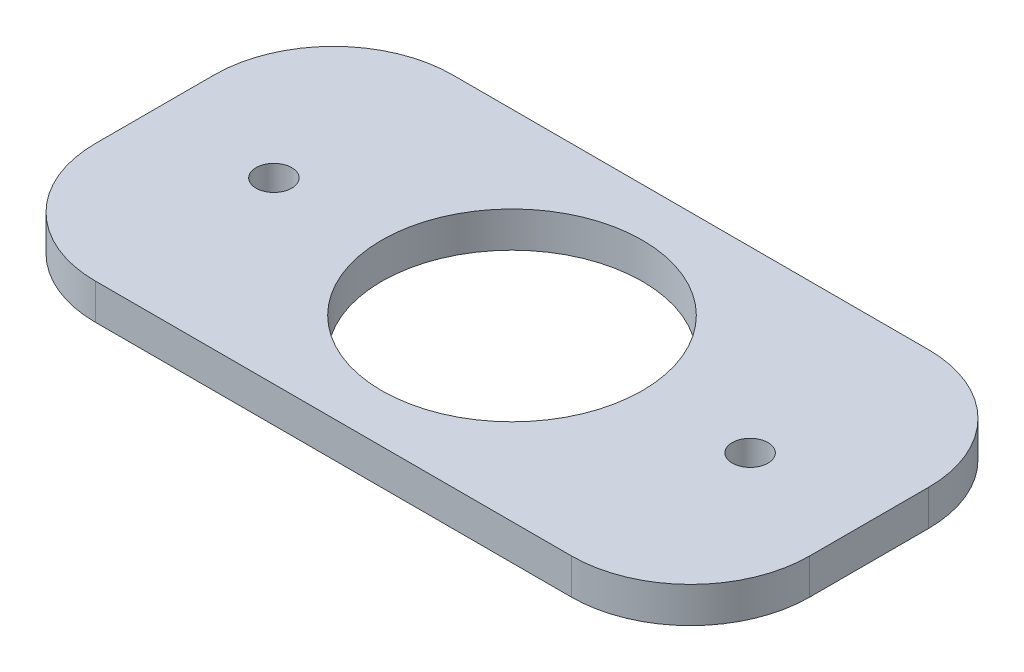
ISO-10303-21;
HEADER;
FILE_DESCRIPTION(('STEP AP214'),'2;1');
FILE_NAME('part.step','',(''),(''),'','','');
FILE_SCHEMA(('AUTOMOTIVE_DESIGN { 1 0 10303 214 1 1 1 1 }'));
ENDSEC;
DATA;
#1=APPLICATION_CONTEXT('core data for automotive mechanical design processes');
#2=APPLICATION_PROTOCOL_DEFINITION('international standard','automotive_design',2000,#1);
#3=PRODUCT_CONTEXT('',#1,'mechanical');
#4=PRODUCT('Part','Part','',(#3));
#5=PRODUCT_RELATED_PRODUCT_CATEGORY('part','',(#4));
#6=PRODUCT_DEFINITION_FORMATION('','',#4);
#7=PRODUCT_DEFINITION_CONTEXT('part definition',#1,'design');
#8=PRODUCT_DEFINITION('design','',#6,#7);
#9=PRODUCT_DEFINITION_SHAPE('','',#8);
#10=(LENGTH_UNIT() NAMED_UNIT(*) SI_UNIT(.MILLI.,.METRE.));
#11=(NAMED_UNIT(*) PLANE_ANGLE_UNIT() SI_UNIT($,.RADIAN.));
#12=(NAMED_UNIT(*) SI_UNIT($,.STERADIAN.) SOLID_ANGLE_UNIT());
#13=UNCERTAINTY_MEASURE_WITH_UNIT(LENGTH_MEASURE(1.E-05),#10,'distance_accuracy_value','');
#14=(GEOMETRIC_REPRESENTATION_CONTEXT(3) GLOBAL_UNCERTAINTY_ASSIGNED_CONTEXT((#13)) GLOBAL_UNIT_ASSIGNED_CONTEXT((#10,
#11,#12)) REPRESENTATION_CONTEXT('',''));
#15=CARTESIAN_POINT('',(0.,0.,0.));
#16=DIRECTION('',(0.,0.,1.));
#17=DIRECTION('',(1.,0.,0.));
#18=AXIS2_PLACEMENT_3D('',#15,#16,#17);
#19=CARTESIAN_POINT('',(30.,3.,15.));
#20=DIRECTION('',(-1.,0.,0.));
#21=DIRECTION('',(0.,0.,1.));
#22=AXIS2_PLACEMENT_3D('',#19,#20,#21);
#23=PLANE('',#22);
#24=DIRECTION('',(0.,0.,-1.));
#25=VECTOR('',#24,1.);
#26=CARTESIAN_POINT('',(30.,3.,15.));
#27=LINE('',#26,#25);
#28=CARTESIAN_POINT('',(30.,3.,5.));
#29=VERTEX_POINT('',#28);
#30=CARTESIAN_POINT('',(30.,3.,-5.));
#31=VERTEX_POINT('',#30);
#32=EDGE_CURVE('E130',#29,#31,#27,.T.);
#33=ORIENTED_EDGE('',*,*,#32,.F.);
#34=DIRECTION('',(0.,-1.,0.));
#35=VECTOR('',#34,1.);
#36=CARTESIAN_POINT('',(30.,3.,5.));
#37=LINE('',#36,#35);
#38=CARTESIAN_POINT('',(30.,0.,5.));
#39=VERTEX_POINT('',#38);
#40=EDGE_CURVE('E167',#29,#39,#37,.T.);
#41=ORIENTED_EDGE('',*,*,#40,.T.);
#42=DIRECTION('',(0.,0.,-1.));
#43=VECTOR('',#42,1.);
#44=CARTESIAN_POINT('',(30.,0.,15.));
#45=LINE('',#44,#43);
#46=CARTESIAN_POINT('',(30.,0.,-5.));
#47=VERTEX_POINT('',#46);
#48=EDGE_CURVE('E132',#39,#47,#45,.T.);
#49=ORIENTED_EDGE('',*,*,#48,.T.);
#50=DIRECTION('',(0.,-1.,0.));
#51=VECTOR('',#50,1.);
#52=CARTESIAN_POINT('',(30.,3.,-5.));
#53=LINE('',#52,#51);
#54=EDGE_CURVE('E154',#47,#31,#53,.F.);
#55=ORIENTED_EDGE('',*,*,#54,.T.);
#56=EDGE_LOOP('',(#33,#41,#49,#55));
#57=FACE_BOUND('',#56,.T.);
#58=ADVANCED_FACE('F39',(#57),#23,.F.);
#59=CARTESIAN_POINT('',(-30.,3.,-15.));
#60=DIRECTION('',(0.,0.,1.));
#61=DIRECTION('',(1.,0.,0.));
#62=AXIS2_PLACEMENT_3D('',#59,#60,#61);
#63=PLANE('',#62);
#64=DIRECTION('',(-1.,0.,0.));
#65=VECTOR('',#64,1.);
#66=CARTESIAN_POINT('',(-30.,3.,-15.));
#67=LINE('',#66,#65);
#68=CARTESIAN_POINT('',(20.,3.,-15.));
#69=VERTEX_POINT('',#68);
#70=CARTESIAN_POINT('',(-20.,3.,-15.));
#71=VERTEX_POINT('',#70);
#72=EDGE_CURVE('E181',#69,#71,#67,.T.);
#73=ORIENTED_EDGE('',*,*,#72,.F.);
#74=DIRECTION('',(0.,-1.,0.));
#75=VECTOR('',#74,1.);
#76=CARTESIAN_POINT('',(20.,3.,-15.));
#77=LINE('',#76,#75);
#78=CARTESIAN_POINT('',(20.,0.,-15.));
#79=VERTEX_POINT('',#78);
#80=EDGE_CURVE('E148',#69,#79,#77,.T.);
#81=ORIENTED_EDGE('',*,*,#80,.T.);
#82=DIRECTION('',(-1.,0.,0.));
#83=VECTOR('',#82,1.);
#84=CARTESIAN_POINT('',(-30.,0.,-15.));
#85=LINE('',#84,#83);
#86=CARTESIAN_POINT('',(-20.,0.,-15.));
#87=VERTEX_POINT('',#86);
#88=EDGE_CURVE('E128',#79,#87,#85,.T.);
#89=ORIENTED_EDGE('',*,*,#88,.T.);
#90=DIRECTION('',(0.,-1.,0.));
#91=VECTOR('',#90,1.);
#92=CARTESIAN_POINT('',(-20.,3.,-15.));
#93=LINE('',#92,#91);
#94=EDGE_CURVE('E111',#87,#71,#93,.F.);
#95=ORIENTED_EDGE('',*,*,#94,.T.);
#96=EDGE_LOOP('',(#73,#81,#89,#95));
#97=FACE_BOUND('',#96,.T.);
#98=ADVANCED_FACE('F229',(#97),#63,.F.);
#99=CARTESIAN_POINT('',(-30.,3.,15.));
#100=DIRECTION('',(1.,0.,0.));
#101=DIRECTION('',(0.,0.,-1.));
#102=AXIS2_PLACEMENT_3D('',#99,#100,#101);
#103=PLANE('',#102);
#104=DIRECTION('',(0.,0.,1.));
#105=VECTOR('',#104,1.);
#106=CARTESIAN_POINT('',(-30.,0.,15.));
#107=LINE('',#106,#105);
#108=CARTESIAN_POINT('',(-30.,0.,-5.));
#109=VERTEX_POINT('',#108);
#110=CARTESIAN_POINT('',(-30.,0.,5.));
#111=VERTEX_POINT('',#110);
#112=EDGE_CURVE('E119',#109,#111,#107,.T.);
#113=ORIENTED_EDGE('',*,*,#112,.T.);
#114=DIRECTION('',(0.,-1.,0.));
#115=VECTOR('',#114,1.);
#116=CARTESIAN_POINT('',(-30.,3.,5.));
#117=LINE('',#116,#115);
#118=CARTESIAN_POINT('',(-30.,3.,5.));
#119=VERTEX_POINT('',#118);
#120=EDGE_CURVE('E163',#111,#119,#117,.F.);
#121=ORIENTED_EDGE('',*,*,#120,.T.);
#122=DIRECTION('',(0.,0.,1.));
#123=VECTOR('',#122,1.);
#124=CARTESIAN_POINT('',(-30.,3.,15.));
#125=LINE('',#124,#123);
#126=CARTESIAN_POINT('',(-30.,3.,-5.));
#127=VERTEX_POINT('',#126);
#128=EDGE_CURVE('E122',#127,#119,#125,.T.);
#129=ORIENTED_EDGE('',*,*,#128,.F.);
#130=DIRECTION('',(0.,-1.,0.));
#131=VECTOR('',#130,1.);
#132=CARTESIAN_POINT('',(-30.,3.,-5.));
#133=LINE('',#132,#131);
#134=EDGE_CURVE('E109',#127,#109,#133,.T.);
#135=ORIENTED_EDGE('',*,*,#134,.T.);
#136=EDGE_LOOP('',(#113,#121,#129,#135));
#137=FACE_BOUND('',#136,.T.);
#138=ADVANCED_FACE('F118',(#137),#103,.F.);
#139=CARTESIAN_POINT('',(-30.,3.,15.));
#140=DIRECTION('',(0.,0.,-1.));
#141=DIRECTION('',(-1.,0.,0.));
#142=AXIS2_PLACEMENT_3D('',#139,#140,#141);
#143=PLANE('',#142);
#144=DIRECTION('',(1.,0.,0.));
#145=VECTOR('',#144,1.);
#146=CARTESIAN_POINT('',(-30.,0.,15.));
#147=LINE('',#146,#145);
#148=CARTESIAN_POINT('',(-20.,0.,15.));
#149=VERTEX_POINT('',#148);
#150=CARTESIAN_POINT('',(20.,0.,15.));
#151=VERTEX_POINT('',#150);
#152=EDGE_CURVE('E127',#149,#151,#147,.T.);
#153=ORIENTED_EDGE('',*,*,#152,.T.);
#154=DIRECTION('',(0.,-1.,0.));
#155=VECTOR('',#154,1.);
#156=CARTESIAN_POINT('',(20.,3.,15.));
#157=LINE('',#156,#155);
#158=CARTESIAN_POINT('',(20.,3.,15.));
#159=VERTEX_POINT('',#158);
#160=EDGE_CURVE('E47',#151,#159,#157,.F.);
#161=ORIENTED_EDGE('',*,*,#160,.T.);
#162=DIRECTION('',(1.,0.,0.));
#163=VECTOR('',#162,1.);
#164=CARTESIAN_POINT('',(-30.,3.,15.));
#165=LINE('',#164,#163);
#166=CARTESIAN_POINT('',(-20.,3.,15.));
#167=VERTEX_POINT('',#166);
#168=EDGE_CURVE('E123',#167,#159,#165,.T.);
#169=ORIENTED_EDGE('',*,*,#168,.F.);
#170=DIRECTION('',(0.,-1.,0.));
#171=VECTOR('',#170,1.);
#172=CARTESIAN_POINT('',(-20.,3.,15.));
#173=LINE('',#172,#171);
#174=EDGE_CURVE('E159',#167,#149,#173,.T.);
#175=ORIENTED_EDGE('',*,*,#174,.T.);
#176=EDGE_LOOP('',(#153,#161,#169,#175));
#177=FACE_BOUND('',#176,.T.);
#178=ADVANCED_FACE('F212',(#177),#143,.F.);
#179=CARTESIAN_POINT('',(0.,3.,0.));
#180=DIRECTION('',(0.,-1.,0.));
#181=DIRECTION('',(0.,0.,-1.));
#182=AXIS2_PLACEMENT_3D('',#179,#180,#181);
#183=PLANE('',#182);
#184=CARTESIAN_POINT('',(-20.,3.,0.));
#185=DIRECTION('',(0.,-1.,0.));
#186=DIRECTION('',(0.,0.,-1.));
#187=AXIS2_PLACEMENT_3D('',#184,#185,#186);
#188=CIRCLE('',#187,1.5);
#189=CARTESIAN_POINT('',(-20.,3.,-1.5));
#190=VERTEX_POINT('',#189);
#191=EDGE_CURVE('E143',#190,#190,#188,.T.);
#192=ORIENTED_EDGE('',*,*,#191,.T.);
#193=EDGE_LOOP('',(#192));
#194=FACE_BOUND('',#193,.T.);
#195=CARTESIAN_POINT('',(20.,3.,0.));
#196=DIRECTION('',(0.,-1.,0.));
#197=DIRECTION('',(0.,0.,-1.));
#198=AXIS2_PLACEMENT_3D('',#195,#196,#197);
#199=CIRCLE('',#198,1.5);
#200=CARTESIAN_POINT('',(20.,3.,-1.5));
#201=VERTEX_POINT('',#200);
#202=EDGE_CURVE('E139',#201,#201,#199,.T.);
#203=ORIENTED_EDGE('',*,*,#202,.T.);
#204=EDGE_LOOP('',(#203));
#205=FACE_BOUND('',#204,.T.);
#206=CARTESIAN_POINT('',(0.,3.,0.));
#207=DIRECTION('',(0.,-1.,0.));
#208=DIRECTION('',(0.,0.,-1.));
#209=AXIS2_PLACEMENT_3D('',#206,#207,#208);
#210=CIRCLE('',#209,10.95);
#211=CARTESIAN_POINT('',(0.,3.,-10.95));
#212=VERTEX_POINT('',#211);
#213=EDGE_CURVE('E140',#212,#212,#210,.T.);
#214=ORIENTED_EDGE('',*,*,#213,.T.);
#215=EDGE_LOOP('',(#214));
#216=FACE_BOUND('',#215,.T.);
#217=ORIENTED_EDGE('',*,*,#168,.T.);
#218=CARTESIAN_POINT('',(20.,3.,5.));
#219=DIRECTION('',(0.,-1.,0.));
#220=DIRECTION('',(0.,0.,-1.));
#221=AXIS2_PLACEMENT_3D('',#218,#219,#220);
#222=CIRCLE('',#221,10.);
#223=EDGE_CURVE('E11',#159,#29,#222,.F.);
#224=ORIENTED_EDGE('',*,*,#223,.T.);
#225=ORIENTED_EDGE('',*,*,#32,.T.);
#226=CARTESIAN_POINT('',(20.,3.,-5.));
#227=DIRECTION('',(0.,-1.,0.));
#228=DIRECTION('',(0.,0.,-1.));
#229=AXIS2_PLACEMENT_3D('',#226,#227,#228);
#230=CIRCLE('',#229,10.);
#231=EDGE_CURVE('E157',#31,#69,#230,.F.);
#232=ORIENTED_EDGE('',*,*,#231,.T.);
#233=ORIENTED_EDGE('',*,*,#72,.T.);
#234=CARTESIAN_POINT('',(-20.,3.,-5.));
#235=DIRECTION('',(0.,-1.,0.));
#236=DIRECTION('',(0.,0.,-1.));
#237=AXIS2_PLACEMENT_3D('',#234,#235,#236);
#238=CIRCLE('',#237,10.);
#239=EDGE_CURVE('E146',#71,#127,#238,.F.);
#240=ORIENTED_EDGE('',*,*,#239,.T.);
#241=ORIENTED_EDGE('',*,*,#128,.T.);
#242=CARTESIAN_POINT('',(-20.,3.,5.));
#243=DIRECTION('',(0.,-1.,0.));
#244=DIRECTION('',(0.,0.,-1.));
#245=AXIS2_PLACEMENT_3D('',#242,#243,#244);
#246=CIRCLE('',#245,10.);
#247=EDGE_CURVE('E165',#119,#167,#246,.F.);
#248=ORIENTED_EDGE('',*,*,#247,.T.);
#249=EDGE_LOOP('',(#217,#224,#225,#232,#233,#240,#241,#248));
#250=FACE_BOUND('',#249,.T.);
#251=ADVANCED_FACE('F198',(#194,#205,#216,#250),#183,.F.);
#252=CARTESIAN_POINT('',(0.,0.,0.));
#253=DIRECTION('',(0.,-1.,0.));
#254=DIRECTION('',(0.,0.,-1.));
#255=AXIS2_PLACEMENT_3D('',#252,#253,#254);
#256=PLANE('',#255);
#257=CARTESIAN_POINT('',(0.,0.,0.));
#258=DIRECTION('',(0.,-1.,0.));
#259=DIRECTION('',(0.,0.,-1.));
#260=AXIS2_PLACEMENT_3D('',#257,#258,#259);
#261=CIRCLE('',#260,10.95);
#262=CARTESIAN_POINT('',(0.,0.,-10.95));
#263=VERTEX_POINT('',#262);
#264=EDGE_CURVE('E188',#263,#263,#261,.T.);
#265=ORIENTED_EDGE('',*,*,#264,.F.);
#266=EDGE_LOOP('',(#265));
#267=FACE_BOUND('',#266,.T.);
#268=CARTESIAN_POINT('',(-20.,0.,0.));
#269=DIRECTION('',(0.,-1.,0.));
#270=DIRECTION('',(0.,0.,-1.));
#271=AXIS2_PLACEMENT_3D('',#268,#269,#270);
#272=CIRCLE('',#271,1.5);
#273=CARTESIAN_POINT('',(-20.,0.,-1.5));
#274=VERTEX_POINT('',#273);
#275=EDGE_CURVE('E141',#274,#274,#272,.T.);
#276=ORIENTED_EDGE('',*,*,#275,.F.);
#277=EDGE_LOOP('',(#276));
#278=FACE_BOUND('',#277,.T.);
#279=CARTESIAN_POINT('',(20.,0.,0.));
#280=DIRECTION('',(0.,-1.,0.));
#281=DIRECTION('',(0.,0.,-1.));
#282=AXIS2_PLACEMENT_3D('',#279,#280,#281);
#283=CIRCLE('',#282,1.5);
#284=CARTESIAN_POINT('',(20.,0.,-1.5));
#285=VERTEX_POINT('',#284);
#286=EDGE_CURVE('E136',#285,#285,#283,.T.);
#287=ORIENTED_EDGE('',*,*,#286,.F.);
#288=EDGE_LOOP('',(#287));
#289=FACE_BOUND('',#288,.T.);
#290=ORIENTED_EDGE('',*,*,#48,.F.);
#291=CARTESIAN_POINT('',(20.,0.,5.));
#292=DIRECTION('',(0.,-1.,0.));
#293=DIRECTION('',(0.,0.,-1.));
#294=AXIS2_PLACEMENT_3D('',#291,#292,#293);
#295=CIRCLE('',#294,10.);
#296=EDGE_CURVE('E61',#39,#151,#295,.T.);
#297=ORIENTED_EDGE('',*,*,#296,.T.);
#298=ORIENTED_EDGE('',*,*,#152,.F.);
#299=CARTESIAN_POINT('',(-20.,0.,5.));
#300=DIRECTION('',(0.,-1.,0.));
#301=DIRECTION('',(0.,0.,-1.));
#302=AXIS2_PLACEMENT_3D('',#299,#300,#301);
#303=CIRCLE('',#302,10.);
#304=EDGE_CURVE('E126',#149,#111,#303,.T.);
#305=ORIENTED_EDGE('',*,*,#304,.T.);
#306=ORIENTED_EDGE('',*,*,#112,.F.);
#307=CARTESIAN_POINT('',(-20.,0.,-5.));
#308=DIRECTION('',(0.,-1.,0.));
#309=DIRECTION('',(0.,0.,-1.));
#310=AXIS2_PLACEMENT_3D('',#307,#308,#309);
#311=CIRCLE('',#310,10.);
#312=EDGE_CURVE('E105',#109,#87,#311,.T.);
#313=ORIENTED_EDGE('',*,*,#312,.T.);
#314=ORIENTED_EDGE('',*,*,#88,.F.);
#315=CARTESIAN_POINT('',(20.,0.,-5.));
#316=DIRECTION('',(0.,-1.,0.));
#317=DIRECTION('',(0.,0.,-1.));
#318=AXIS2_PLACEMENT_3D('',#315,#316,#317);
#319=CIRCLE('',#318,10.);
#320=EDGE_CURVE('E151',#79,#47,#319,.T.);
#321=ORIENTED_EDGE('',*,*,#320,.T.);
#322=EDGE_LOOP('',(#290,#297,#298,#305,#306,#313,#314,#321));
#323=FACE_BOUND('',#322,.T.);
#324=ADVANCED_FACE('F125',(#267,#278,#289,#323),#256,.T.);
#325=CARTESIAN_POINT('',(20.,-20.,0.));
#326=DIRECTION('',(0.,1.,0.));
#327=DIRECTION('',(0.,0.,1.));
#328=AXIS2_PLACEMENT_3D('',#325,#326,#327);
#329=CYLINDRICAL_SURFACE('',#328,1.5);
#330=ORIENTED_EDGE('',*,*,#286,.T.);
#331=EDGE_LOOP('',(#330));
#332=FACE_BOUND('',#331,.T.);
#333=ORIENTED_EDGE('',*,*,#202,.F.);
#334=EDGE_LOOP('',(#333));
#335=FACE_BOUND('',#334,.T.);
#336=ADVANCED_FACE('F197',(#332,#335),#329,.F.);
#337=CARTESIAN_POINT('',(-20.,-20.,0.));
#338=DIRECTION('',(0.,1.,0.));
#339=DIRECTION('',(0.,0.,1.));
#340=AXIS2_PLACEMENT_3D('',#337,#338,#339);
#341=CYLINDRICAL_SURFACE('',#340,1.5);
#342=ORIENTED_EDGE('',*,*,#275,.T.);
#343=EDGE_LOOP('',(#342));
#344=FACE_BOUND('',#343,.T.);
#345=ORIENTED_EDGE('',*,*,#191,.F.);
#346=EDGE_LOOP('',(#345));
#347=FACE_BOUND('',#346,.T.);
#348=ADVANCED_FACE('F206',(#344,#347),#341,.F.);
#349=CARTESIAN_POINT('',(-20.,3.,-5.));
#350=DIRECTION('',(0.,-1.,0.));
#351=DIRECTION('',(0.,0.,-1.));
#352=AXIS2_PLACEMENT_3D('',#349,#350,#351);
#353=CYLINDRICAL_SURFACE('',#352,10.);
#354=ORIENTED_EDGE('',*,*,#239,.F.);
#355=ORIENTED_EDGE('',*,*,#94,.F.);
#356=ORIENTED_EDGE('',*,*,#312,.F.);
#357=ORIENTED_EDGE('',*,*,#134,.F.);
#358=EDGE_LOOP('',(#354,#355,#356,#357));
#359=FACE_BOUND('',#358,.T.);
#360=ADVANCED_FACE('F108',(#359),#353,.T.);
#361=CARTESIAN_POINT('',(20.,3.,-5.));
#362=DIRECTION('',(0.,-1.,0.));
#363=DIRECTION('',(0.,0.,-1.));
#364=AXIS2_PLACEMENT_3D('',#361,#362,#363);
#365=CYLINDRICAL_SURFACE('',#364,10.);
#366=ORIENTED_EDGE('',*,*,#231,.F.);
#367=ORIENTED_EDGE('',*,*,#54,.F.);
#368=ORIENTED_EDGE('',*,*,#320,.F.);
#369=ORIENTED_EDGE('',*,*,#80,.F.);
#370=EDGE_LOOP('',(#366,#367,#368,#369));
#371=FACE_BOUND('',#370,.T.);
#372=ADVANCED_FACE('F226',(#371),#365,.T.);
#373=CARTESIAN_POINT('',(-20.,3.,5.));
#374=DIRECTION('',(0.,-1.,0.));
#375=DIRECTION('',(0.,0.,-1.));
#376=AXIS2_PLACEMENT_3D('',#373,#374,#375);
#377=CYLINDRICAL_SURFACE('',#376,10.);
#378=ORIENTED_EDGE('',*,*,#247,.F.);
#379=ORIENTED_EDGE('',*,*,#120,.F.);
#380=ORIENTED_EDGE('',*,*,#304,.F.);
#381=ORIENTED_EDGE('',*,*,#174,.F.);
#382=EDGE_LOOP('',(#378,#379,#380,#381));
#383=FACE_BOUND('',#382,.T.);
#384=ADVANCED_FACE('F220',(#383),#377,.T.);
#385=CARTESIAN_POINT('',(20.,3.,5.));
#386=DIRECTION('',(0.,-1.,0.));
#387=DIRECTION('',(0.,0.,-1.));
#388=AXIS2_PLACEMENT_3D('',#385,#386,#387);
#389=CYLINDRICAL_SURFACE('',#388,10.);
#390=ORIENTED_EDGE('',*,*,#223,.F.);
#391=ORIENTED_EDGE('',*,*,#160,.F.);
#392=ORIENTED_EDGE('',*,*,#296,.F.);
#393=ORIENTED_EDGE('',*,*,#40,.F.);
#394=EDGE_LOOP('',(#390,#391,#392,#393));
#395=FACE_BOUND('',#394,.T.);
#396=ADVANCED_FACE('F41',(#395),#389,.T.);
#397=CARTESIAN_POINT('',(0.,-20.,0.));
#398=DIRECTION('',(0.,1.,0.));
#399=DIRECTION('',(0.,0.,1.));
#400=AXIS2_PLACEMENT_3D('',#397,#398,#399);
#401=CYLINDRICAL_SURFACE('',#400,10.95);
#402=ORIENTED_EDGE('',*,*,#264,.T.);
#403=EDGE_LOOP('',(#402));
#404=FACE_BOUND('',#403,.T.);
#405=ORIENTED_EDGE('',*,*,#213,.F.);
#406=EDGE_LOOP('',(#405));
#407=FACE_BOUND('',#406,.T.);
#408=ADVANCED_FACE('F192',(#404,#407),#401,.F.);
#409=CLOSED_SHELL('',(#58,#98,#138,#178,#251,#324,#336,#348,#360,#372,#384,#396,#408));
#410=MANIFOLD_SOLID_BREP('B2',#409);
#411=ADVANCED_BREP_SHAPE_REPRESENTATION('',(#18,#410),#14);
#412=SHAPE_DEFINITION_REPRESENTATION(#9,#411);
ENDSEC;
END-ISO-10303-21;
